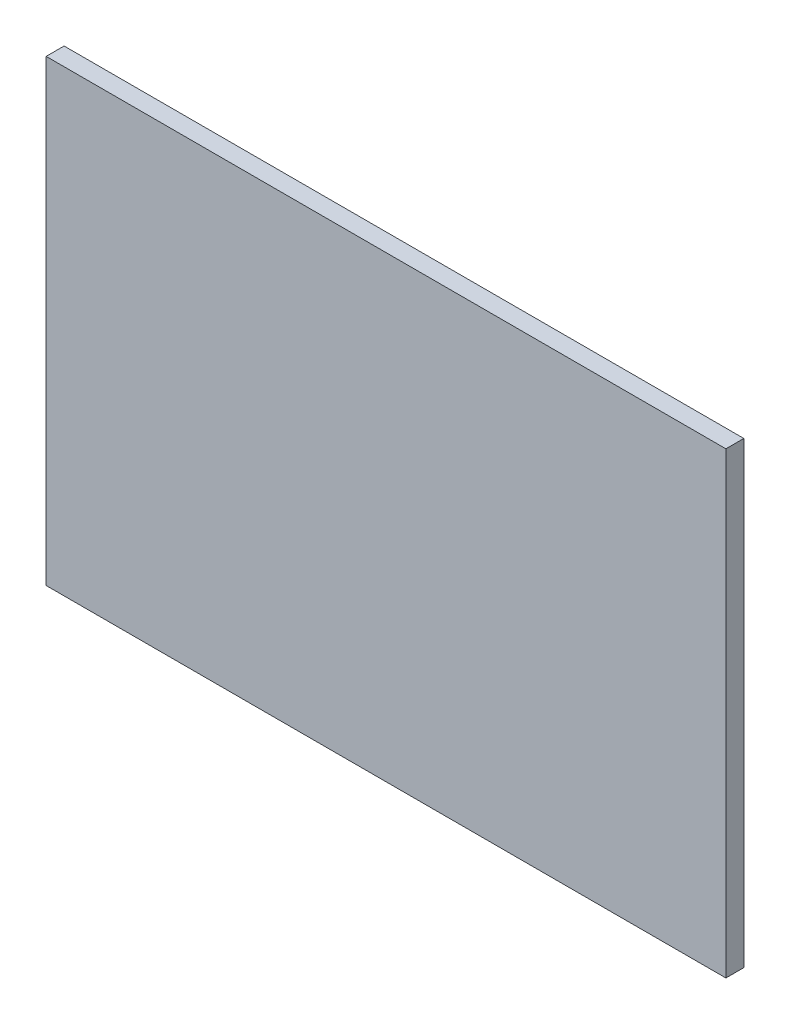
ISO-10303-21;
HEADER;
FILE_DESCRIPTION(('STEP AP214'),'2;1');
FILE_NAME('part.step','',(''),(''),'','','');
FILE_SCHEMA(('AUTOMOTIVE_DESIGN { 1 0 10303 214 1 1 1 1 }'));
ENDSEC;
DATA;
#1=APPLICATION_CONTEXT('core data for automotive mechanical design processes');
#2=APPLICATION_PROTOCOL_DEFINITION('international standard','automotive_design',2000,#1);
#3=PRODUCT_CONTEXT('',#1,'mechanical');
#4=PRODUCT('Part','Part','',(#3));
#5=PRODUCT_RELATED_PRODUCT_CATEGORY('part','',(#4));
#6=PRODUCT_DEFINITION_FORMATION('','',#4);
#7=PRODUCT_DEFINITION_CONTEXT('part definition',#1,'design');
#8=PRODUCT_DEFINITION('design','',#6,#7);
#9=PRODUCT_DEFINITION_SHAPE('','',#8);
#10=(LENGTH_UNIT() NAMED_UNIT(*) SI_UNIT(.MILLI.,.METRE.));
#11=(NAMED_UNIT(*) PLANE_ANGLE_UNIT() SI_UNIT($,.RADIAN.));
#12=(NAMED_UNIT(*) SI_UNIT($,.STERADIAN.) SOLID_ANGLE_UNIT());
#13=UNCERTAINTY_MEASURE_WITH_UNIT(LENGTH_MEASURE(1.E-05),#10,'distance_accuracy_value','');
#14=(GEOMETRIC_REPRESENTATION_CONTEXT(3) GLOBAL_UNCERTAINTY_ASSIGNED_CONTEXT((#13)) GLOBAL_UNIT_ASSIGNED_CONTEXT((#10,
#11,#12)) REPRESENTATION_CONTEXT('',''));
#15=CARTESIAN_POINT('',(0.,0.,0.));
#16=DIRECTION('',(0.,0.,1.));
#17=DIRECTION('',(1.,0.,0.));
#18=AXIS2_PLACEMENT_3D('',#15,#16,#17);
#19=CARTESIAN_POINT('',(0.,0.,25.));
#20=DIRECTION('',(1.,0.,0.));
#21=DIRECTION('',(0.,0.,-1.));
#22=AXIS2_PLACEMENT_3D('',#19,#20,#21);
#23=PLANE('',#22);
#24=DIRECTION('',(0.,-1.,0.));
#25=VECTOR('',#24,1.);
#26=CARTESIAN_POINT('',(0.,0.,0.));
#27=LINE('',#26,#25);
#28=CARTESIAN_POINT('',(0.,638.5,0.));
#29=VERTEX_POINT('',#28);
#30=CARTESIAN_POINT('',(0.,0.,0.));
#31=VERTEX_POINT('',#30);
#32=EDGE_CURVE('E97',#29,#31,#27,.T.);
#33=ORIENTED_EDGE('',*,*,#32,.T.);
#34=DIRECTION('',(0.,0.,-1.));
#35=VECTOR('',#34,1.);
#36=CARTESIAN_POINT('',(0.,0.,25.));
#37=LINE('',#36,#35);
#38=CARTESIAN_POINT('',(0.,0.,25.));
#39=VERTEX_POINT('',#38);
#40=EDGE_CURVE('E11',#39,#31,#37,.T.);
#41=ORIENTED_EDGE('',*,*,#40,.F.);
#42=DIRECTION('',(0.,-1.,0.));
#43=VECTOR('',#42,1.);
#44=CARTESIAN_POINT('',(0.,0.,25.));
#45=LINE('',#44,#43);
#46=CARTESIAN_POINT('',(0.,638.5,25.));
#47=VERTEX_POINT('',#46);
#48=EDGE_CURVE('E85',#47,#39,#45,.T.);
#49=ORIENTED_EDGE('',*,*,#48,.F.);
#50=DIRECTION('',(0.,0.,-1.));
#51=VECTOR('',#50,1.);
#52=CARTESIAN_POINT('',(0.,638.5,25.));
#53=LINE('',#52,#51);
#54=EDGE_CURVE('E93',#47,#29,#53,.T.);
#55=ORIENTED_EDGE('',*,*,#54,.T.);
#56=EDGE_LOOP('',(#33,#41,#49,#55));
#57=FACE_BOUND('',#56,.T.);
#58=ADVANCED_FACE('F34',(#57),#23,.F.);
#59=CARTESIAN_POINT('',(0.,0.,25.));
#60=DIRECTION('',(0.,1.,0.));
#61=DIRECTION('',(0.,0.,1.));
#62=AXIS2_PLACEMENT_3D('',#59,#60,#61);
#63=PLANE('',#62);
#64=DIRECTION('',(1.,0.,0.));
#65=VECTOR('',#64,1.);
#66=CARTESIAN_POINT('',(0.,0.,0.));
#67=LINE('',#66,#65);
#68=CARTESIAN_POINT('',(947.,0.,0.));
#69=VERTEX_POINT('',#68);
#70=EDGE_CURVE('E89',#31,#69,#67,.T.);
#71=ORIENTED_EDGE('',*,*,#70,.T.);
#72=DIRECTION('',(0.,0.,-1.));
#73=VECTOR('',#72,1.);
#74=CARTESIAN_POINT('',(947.,0.,25.));
#75=LINE('',#74,#73);
#76=CARTESIAN_POINT('',(947.,0.,25.));
#77=VERTEX_POINT('',#76);
#78=EDGE_CURVE('E42',#77,#69,#75,.T.);
#79=ORIENTED_EDGE('',*,*,#78,.F.);
#80=DIRECTION('',(1.,0.,0.));
#81=VECTOR('',#80,1.);
#82=CARTESIAN_POINT('',(0.,0.,25.));
#83=LINE('',#82,#81);
#84=EDGE_CURVE('E80',#39,#77,#83,.T.);
#85=ORIENTED_EDGE('',*,*,#84,.F.);
#86=ORIENTED_EDGE('',*,*,#40,.T.);
#87=EDGE_LOOP('',(#71,#79,#85,#86));
#88=FACE_BOUND('',#87,.T.);
#89=ADVANCED_FACE('F88',(#88),#63,.F.);
#90=CARTESIAN_POINT('',(947.,0.,25.));
#91=DIRECTION('',(-1.,0.,0.));
#92=DIRECTION('',(0.,0.,1.));
#93=AXIS2_PLACEMENT_3D('',#90,#91,#92);
#94=PLANE('',#93);
#95=DIRECTION('',(0.,1.,0.));
#96=VECTOR('',#95,1.);
#97=CARTESIAN_POINT('',(947.,0.,0.));
#98=LINE('',#97,#96);
#99=CARTESIAN_POINT('',(947.,638.5,0.));
#100=VERTEX_POINT('',#99);
#101=EDGE_CURVE('E67',#69,#100,#98,.T.);
#102=ORIENTED_EDGE('',*,*,#101,.T.);
#103=DIRECTION('',(0.,0.,-1.));
#104=VECTOR('',#103,1.);
#105=CARTESIAN_POINT('',(947.,638.5,25.));
#106=LINE('',#105,#104);
#107=CARTESIAN_POINT('',(947.,638.5,25.));
#108=VERTEX_POINT('',#107);
#109=EDGE_CURVE('E90',#108,#100,#106,.T.);
#110=ORIENTED_EDGE('',*,*,#109,.F.);
#111=DIRECTION('',(0.,1.,0.));
#112=VECTOR('',#111,1.);
#113=CARTESIAN_POINT('',(947.,0.,25.));
#114=LINE('',#113,#112);
#115=EDGE_CURVE('E83',#77,#108,#114,.T.);
#116=ORIENTED_EDGE('',*,*,#115,.F.);
#117=ORIENTED_EDGE('',*,*,#78,.T.);
#118=EDGE_LOOP('',(#102,#110,#116,#117));
#119=FACE_BOUND('',#118,.T.);
#120=ADVANCED_FACE('F91',(#119),#94,.F.);
#121=CARTESIAN_POINT('',(0.,638.5,25.));
#122=DIRECTION('',(0.,-1.,0.));
#123=DIRECTION('',(0.,0.,-1.));
#124=AXIS2_PLACEMENT_3D('',#121,#122,#123);
#125=PLANE('',#124);
#126=DIRECTION('',(-1.,0.,0.));
#127=VECTOR('',#126,1.);
#128=CARTESIAN_POINT('',(0.,638.5,0.));
#129=LINE('',#128,#127);
#130=EDGE_CURVE('E73',#100,#29,#129,.T.);
#131=ORIENTED_EDGE('',*,*,#130,.T.);
#132=ORIENTED_EDGE('',*,*,#54,.F.);
#133=DIRECTION('',(-1.,0.,0.));
#134=VECTOR('',#133,1.);
#135=CARTESIAN_POINT('',(0.,638.5,25.));
#136=LINE('',#135,#134);
#137=EDGE_CURVE('E50',#108,#47,#136,.T.);
#138=ORIENTED_EDGE('',*,*,#137,.F.);
#139=ORIENTED_EDGE('',*,*,#109,.T.);
#140=EDGE_LOOP('',(#131,#132,#138,#139));
#141=FACE_BOUND('',#140,.T.);
#142=ADVANCED_FACE('F104',(#141),#125,.F.);
#143=CARTESIAN_POINT('',(0.,638.5,25.));
#144=DIRECTION('',(0.,0.,-1.));
#145=DIRECTION('',(-1.,0.,0.));
#146=AXIS2_PLACEMENT_3D('',#143,#144,#145);
#147=PLANE('',#146);
#148=ORIENTED_EDGE('',*,*,#48,.T.);
#149=ORIENTED_EDGE('',*,*,#84,.T.);
#150=ORIENTED_EDGE('',*,*,#115,.T.);
#151=ORIENTED_EDGE('',*,*,#137,.T.);
#152=EDGE_LOOP('',(#148,#149,#150,#151));
#153=FACE_BOUND('',#152,.T.);
#154=ADVANCED_FACE('F81',(#153),#147,.F.);
#155=CARTESIAN_POINT('',(0.,638.5,0.));
#156=DIRECTION('',(0.,0.,-1.));
#157=DIRECTION('',(-1.,0.,0.));
#158=AXIS2_PLACEMENT_3D('',#155,#156,#157);
#159=PLANE('',#158);
#160=ORIENTED_EDGE('',*,*,#32,.F.);
#161=ORIENTED_EDGE('',*,*,#130,.F.);
#162=ORIENTED_EDGE('',*,*,#101,.F.);
#163=ORIENTED_EDGE('',*,*,#70,.F.);
#164=EDGE_LOOP('',(#160,#161,#162,#163));
#165=FACE_BOUND('',#164,.T.);
#166=ADVANCED_FACE('F107',(#165),#159,.T.);
#167=CLOSED_SHELL('',(#58,#89,#120,#142,#154,#166));
#168=MANIFOLD_SOLID_BREP('B2',#167);
#169=ADVANCED_BREP_SHAPE_REPRESENTATION('',(#18,#168),#14);
#170=SHAPE_DEFINITION_REPRESENTATION(#9,#169);
ENDSEC;
END-ISO-10303-21;
